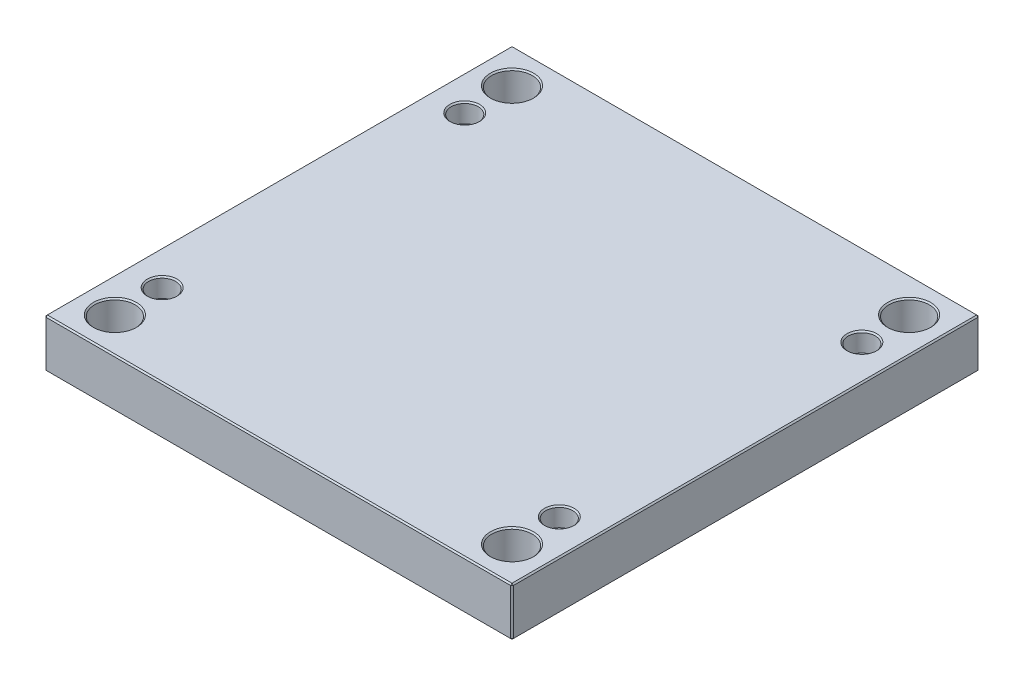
ISO-10303-21;
HEADER;
FILE_DESCRIPTION(('STEP AP214'),'2;1');
FILE_NAME('part.step','',(''),(''),'','','');
FILE_SCHEMA(('AUTOMOTIVE_DESIGN { 1 0 10303 214 1 1 1 1 }'));
ENDSEC;
DATA;
#1=APPLICATION_CONTEXT('core data for automotive mechanical design processes');
#2=APPLICATION_PROTOCOL_DEFINITION('international standard','automotive_design',2000,#1);
#3=PRODUCT_CONTEXT('',#1,'mechanical');
#4=PRODUCT('Part','Part','',(#3));
#5=PRODUCT_RELATED_PRODUCT_CATEGORY('part','',(#4));
#6=PRODUCT_DEFINITION_FORMATION('','',#4);
#7=PRODUCT_DEFINITION_CONTEXT('part definition',#1,'design');
#8=PRODUCT_DEFINITION('design','',#6,#7);
#9=PRODUCT_DEFINITION_SHAPE('','',#8);
#10=(LENGTH_UNIT() NAMED_UNIT(*) SI_UNIT(.MILLI.,.METRE.));
#11=(NAMED_UNIT(*) PLANE_ANGLE_UNIT() SI_UNIT($,.RADIAN.));
#12=(NAMED_UNIT(*) SI_UNIT($,.STERADIAN.) SOLID_ANGLE_UNIT());
#13=UNCERTAINTY_MEASURE_WITH_UNIT(LENGTH_MEASURE(1.E-05),#10,'distance_accuracy_value','');
#14=(GEOMETRIC_REPRESENTATION_CONTEXT(3) GLOBAL_UNCERTAINTY_ASSIGNED_CONTEXT((#13)) GLOBAL_UNIT_ASSIGNED_CONTEXT((#10,
#11,#12)) REPRESENTATION_CONTEXT('',''));
#15=CARTESIAN_POINT('',(0.,0.,0.));
#16=DIRECTION('',(0.,0.,1.));
#17=DIRECTION('',(1.,0.,0.));
#18=AXIS2_PLACEMENT_3D('',#15,#16,#17);
#19=CARTESIAN_POINT('',(-173.,36.,173.));
#20=DIRECTION('',(1.,0.,0.));
#21=DIRECTION('',(0.,0.,-1.));
#22=AXIS2_PLACEMENT_3D('',#19,#20,#21);
#23=PLANE('',#22);
#24=DIRECTION('',(0.,-1.,0.));
#25=VECTOR('',#24,1.);
#26=CARTESIAN_POINT('',(-173.,36.,-172.));
#27=LINE('',#26,#25);
#28=CARTESIAN_POINT('',(-173.,35.,-172.));
#29=VERTEX_POINT('',#28);
#30=CARTESIAN_POINT('',(-173.,1.,-172.));
#31=VERTEX_POINT('',#30);
#32=EDGE_CURVE('E115',#29,#31,#27,.T.);
#33=ORIENTED_EDGE('',*,*,#32,.T.);
#34=DIRECTION('',(0.,0.,1.));
#35=VECTOR('',#34,1.);
#36=CARTESIAN_POINT('',(-173.,1.,173.));
#37=LINE('',#36,#35);
#38=CARTESIAN_POINT('',(-173.,1.,172.));
#39=VERTEX_POINT('',#38);
#40=EDGE_CURVE('E111',#31,#39,#37,.T.);
#41=ORIENTED_EDGE('',*,*,#40,.T.);
#42=DIRECTION('',(0.,1.,0.));
#43=VECTOR('',#42,1.);
#44=CARTESIAN_POINT('',(-173.,36.,172.));
#45=LINE('',#44,#43);
#46=CARTESIAN_POINT('',(-173.,35.,172.));
#47=VERTEX_POINT('',#46);
#48=EDGE_CURVE('E104',#39,#47,#45,.T.);
#49=ORIENTED_EDGE('',*,*,#48,.T.);
#50=DIRECTION('',(0.,0.,-1.));
#51=VECTOR('',#50,1.);
#52=CARTESIAN_POINT('',(-173.,35.,-173.));
#53=LINE('',#52,#51);
#54=EDGE_CURVE('E108',#47,#29,#53,.T.);
#55=ORIENTED_EDGE('',*,*,#54,.T.);
#56=EDGE_LOOP('',(#33,#41,#49,#55));
#57=FACE_BOUND('',#56,.T.);
#58=ADVANCED_FACE('F16',(#57),#23,.F.);
#59=CARTESIAN_POINT('',(173.,36.,173.));
#60=DIRECTION('',(0.,0.,-1.));
#61=DIRECTION('',(-1.,0.,0.));
#62=AXIS2_PLACEMENT_3D('',#59,#60,#61);
#63=PLANE('',#62);
#64=DIRECTION('',(-1.,0.,0.));
#65=VECTOR('',#64,1.);
#66=CARTESIAN_POINT('',(-173.,35.,173.));
#67=LINE('',#66,#65);
#68=CARTESIAN_POINT('',(172.,35.,173.));
#69=VERTEX_POINT('',#68);
#70=CARTESIAN_POINT('',(-172.,35.,173.));
#71=VERTEX_POINT('',#70);
#72=EDGE_CURVE('E170',#69,#71,#67,.T.);
#73=ORIENTED_EDGE('',*,*,#72,.T.);
#74=DIRECTION('',(0.,-1.,0.));
#75=VECTOR('',#74,1.);
#76=CARTESIAN_POINT('',(-172.,36.,173.));
#77=LINE('',#76,#75);
#78=CARTESIAN_POINT('',(-172.,1.,173.));
#79=VERTEX_POINT('',#78);
#80=EDGE_CURVE('E123',#71,#79,#77,.T.);
#81=ORIENTED_EDGE('',*,*,#80,.T.);
#82=DIRECTION('',(1.,0.,0.));
#83=VECTOR('',#82,1.);
#84=CARTESIAN_POINT('',(173.,1.,173.));
#85=LINE('',#84,#83);
#86=CARTESIAN_POINT('',(172.,1.,173.));
#87=VERTEX_POINT('',#86);
#88=EDGE_CURVE('E174',#79,#87,#85,.T.);
#89=ORIENTED_EDGE('',*,*,#88,.T.);
#90=DIRECTION('',(0.,1.,0.));
#91=VECTOR('',#90,1.);
#92=CARTESIAN_POINT('',(172.,36.,173.));
#93=LINE('',#92,#91);
#94=EDGE_CURVE('E172',#87,#69,#93,.T.);
#95=ORIENTED_EDGE('',*,*,#94,.T.);
#96=EDGE_LOOP('',(#73,#81,#89,#95));
#97=FACE_BOUND('',#96,.T.);
#98=ADVANCED_FACE('F413',(#97),#63,.F.);
#99=CARTESIAN_POINT('',(173.,36.,173.));
#100=DIRECTION('',(-1.,0.,0.));
#101=DIRECTION('',(0.,0.,1.));
#102=AXIS2_PLACEMENT_3D('',#99,#100,#101);
#103=PLANE('',#102);
#104=DIRECTION('',(0.,0.,-1.));
#105=VECTOR('',#104,1.);
#106=CARTESIAN_POINT('',(173.,1.,173.));
#107=LINE('',#106,#105);
#108=CARTESIAN_POINT('',(173.,1.,172.));
#109=VERTEX_POINT('',#108);
#110=CARTESIAN_POINT('',(173.,1.,-172.));
#111=VERTEX_POINT('',#110);
#112=EDGE_CURVE('E165',#109,#111,#107,.T.);
#113=ORIENTED_EDGE('',*,*,#112,.T.);
#114=DIRECTION('',(0.,1.,0.));
#115=VECTOR('',#114,1.);
#116=CARTESIAN_POINT('',(173.,36.,-172.));
#117=LINE('',#116,#115);
#118=CARTESIAN_POINT('',(173.,35.,-172.));
#119=VERTEX_POINT('',#118);
#120=EDGE_CURVE('E167',#111,#119,#117,.T.);
#121=ORIENTED_EDGE('',*,*,#120,.T.);
#122=DIRECTION('',(0.,0.,1.));
#123=VECTOR('',#122,1.);
#124=CARTESIAN_POINT('',(173.,35.,173.));
#125=LINE('',#124,#123);
#126=CARTESIAN_POINT('',(173.,35.,172.));
#127=VERTEX_POINT('',#126);
#128=EDGE_CURVE('E161',#119,#127,#125,.T.);
#129=ORIENTED_EDGE('',*,*,#128,.T.);
#130=DIRECTION('',(0.,-1.,0.));
#131=VECTOR('',#130,1.);
#132=CARTESIAN_POINT('',(173.,36.,172.));
#133=LINE('',#132,#131);
#134=EDGE_CURVE('E163',#127,#109,#133,.T.);
#135=ORIENTED_EDGE('',*,*,#134,.T.);
#136=EDGE_LOOP('',(#113,#121,#129,#135));
#137=FACE_BOUND('',#136,.T.);
#138=ADVANCED_FACE('F406',(#137),#103,.F.);
#139=CARTESIAN_POINT('',(173.,36.,-173.));
#140=DIRECTION('',(0.,0.,1.));
#141=DIRECTION('',(1.,0.,0.));
#142=AXIS2_PLACEMENT_3D('',#139,#140,#141);
#143=PLANE('',#142);
#144=DIRECTION('',(0.,-1.,0.));
#145=VECTOR('',#144,1.);
#146=CARTESIAN_POINT('',(172.,36.,-173.));
#147=LINE('',#146,#145);
#148=CARTESIAN_POINT('',(172.,35.,-173.));
#149=VERTEX_POINT('',#148);
#150=CARTESIAN_POINT('',(172.,1.,-173.));
#151=VERTEX_POINT('',#150);
#152=EDGE_CURVE('E154',#149,#151,#147,.T.);
#153=ORIENTED_EDGE('',*,*,#152,.T.);
#154=DIRECTION('',(-1.,0.,0.));
#155=VECTOR('',#154,1.);
#156=CARTESIAN_POINT('',(173.,1.,-173.));
#157=LINE('',#156,#155);
#158=CARTESIAN_POINT('',(-172.,1.,-173.));
#159=VERTEX_POINT('',#158);
#160=EDGE_CURVE('E159',#151,#159,#157,.T.);
#161=ORIENTED_EDGE('',*,*,#160,.T.);
#162=DIRECTION('',(0.,1.,0.));
#163=VECTOR('',#162,1.);
#164=CARTESIAN_POINT('',(-172.,36.,-173.));
#165=LINE('',#164,#163);
#166=CARTESIAN_POINT('',(-172.,35.,-173.));
#167=VERTEX_POINT('',#166);
#168=EDGE_CURVE('E156',#159,#167,#165,.T.);
#169=ORIENTED_EDGE('',*,*,#168,.T.);
#170=DIRECTION('',(1.,0.,0.));
#171=VECTOR('',#170,1.);
#172=CARTESIAN_POINT('',(173.,35.,-173.));
#173=LINE('',#172,#171);
#174=EDGE_CURVE('E152',#167,#149,#173,.T.);
#175=ORIENTED_EDGE('',*,*,#174,.T.);
#176=EDGE_LOOP('',(#153,#161,#169,#175));
#177=FACE_BOUND('',#176,.T.);
#178=ADVANCED_FACE('F431',(#177),#143,.F.);
#179=CARTESIAN_POINT('',(0.,36.,0.));
#180=DIRECTION('',(0.,1.,0.));
#181=DIRECTION('',(0.,0.,1.));
#182=AXIS2_PLACEMENT_3D('',#179,#180,#181);
#183=PLANE('',#182);
#184=CARTESIAN_POINT('',(-147.,36.,147.));
#185=DIRECTION('',(0.,1.,0.));
#186=DIRECTION('',(0.,0.,1.));
#187=AXIS2_PLACEMENT_3D('',#184,#185,#186);
#188=CIRCLE('',#187,16.);
#189=CARTESIAN_POINT('',(-147.,36.,163.));
#190=VERTEX_POINT('',#189);
#191=EDGE_CURVE('E317',#190,#190,#188,.F.);
#192=ORIENTED_EDGE('',*,*,#191,.T.);
#193=EDGE_LOOP('',(#192));
#194=FACE_BOUND('',#193,.T.);
#195=CARTESIAN_POINT('',(147.,36.,147.));
#196=DIRECTION('',(0.,1.,0.));
#197=DIRECTION('',(0.,0.,1.));
#198=AXIS2_PLACEMENT_3D('',#195,#196,#197);
#199=CIRCLE('',#198,16.);
#200=CARTESIAN_POINT('',(147.,36.,163.));
#201=VERTEX_POINT('',#200);
#202=EDGE_CURVE('E314',#201,#201,#199,.F.);
#203=ORIENTED_EDGE('',*,*,#202,.T.);
#204=EDGE_LOOP('',(#203));
#205=FACE_BOUND('',#204,.T.);
#206=CARTESIAN_POINT('',(147.,36.,-147.));
#207=DIRECTION('',(0.,1.,0.));
#208=DIRECTION('',(0.,0.,1.));
#209=AXIS2_PLACEMENT_3D('',#206,#207,#208);
#210=CIRCLE('',#209,16.);
#211=CARTESIAN_POINT('',(147.,36.,-131.));
#212=VERTEX_POINT('',#211);
#213=EDGE_CURVE('E311',#212,#212,#210,.F.);
#214=ORIENTED_EDGE('',*,*,#213,.T.);
#215=EDGE_LOOP('',(#214));
#216=FACE_BOUND('',#215,.T.);
#217=CARTESIAN_POINT('',(-147.,36.,-147.));
#218=DIRECTION('',(0.,1.,0.));
#219=DIRECTION('',(0.,0.,1.));
#220=AXIS2_PLACEMENT_3D('',#217,#218,#219);
#221=CIRCLE('',#220,16.);
#222=CARTESIAN_POINT('',(-147.,36.,-131.));
#223=VERTEX_POINT('',#222);
#224=EDGE_CURVE('E308',#223,#223,#221,.F.);
#225=ORIENTED_EDGE('',*,*,#224,.T.);
#226=EDGE_LOOP('',(#225));
#227=FACE_BOUND('',#226,.T.);
#228=CARTESIAN_POINT('',(-147.,36.,112.));
#229=DIRECTION('',(0.,1.,0.));
#230=DIRECTION('',(0.,0.,1.));
#231=AXIS2_PLACEMENT_3D('',#228,#229,#230);
#232=CIRCLE('',#231,11.);
#233=CARTESIAN_POINT('',(-147.,36.,123.));
#234=VERTEX_POINT('',#233);
#235=EDGE_CURVE('E290',#234,#234,#232,.F.);
#236=ORIENTED_EDGE('',*,*,#235,.T.);
#237=EDGE_LOOP('',(#236));
#238=FACE_BOUND('',#237,.T.);
#239=CARTESIAN_POINT('',(147.,36.,112.));
#240=DIRECTION('',(0.,1.,0.));
#241=DIRECTION('',(0.,0.,1.));
#242=AXIS2_PLACEMENT_3D('',#239,#240,#241);
#243=CIRCLE('',#242,11.);
#244=CARTESIAN_POINT('',(147.,36.,123.));
#245=VERTEX_POINT('',#244);
#246=EDGE_CURVE('E287',#245,#245,#243,.F.);
#247=ORIENTED_EDGE('',*,*,#246,.T.);
#248=EDGE_LOOP('',(#247));
#249=FACE_BOUND('',#248,.T.);
#250=CARTESIAN_POINT('',(147.,36.,-112.));
#251=DIRECTION('',(0.,1.,0.));
#252=DIRECTION('',(0.,0.,1.));
#253=AXIS2_PLACEMENT_3D('',#250,#251,#252);
#254=CIRCLE('',#253,11.);
#255=CARTESIAN_POINT('',(147.,36.,-101.));
#256=VERTEX_POINT('',#255);
#257=EDGE_CURVE('E284',#256,#256,#254,.F.);
#258=ORIENTED_EDGE('',*,*,#257,.T.);
#259=EDGE_LOOP('',(#258));
#260=FACE_BOUND('',#259,.T.);
#261=CARTESIAN_POINT('',(-147.,36.,-112.));
#262=DIRECTION('',(0.,1.,0.));
#263=DIRECTION('',(0.,0.,1.));
#264=AXIS2_PLACEMENT_3D('',#261,#262,#263);
#265=CIRCLE('',#264,11.);
#266=CARTESIAN_POINT('',(-147.,36.,-101.));
#267=VERTEX_POINT('',#266);
#268=EDGE_CURVE('E281',#267,#267,#265,.F.);
#269=ORIENTED_EDGE('',*,*,#268,.T.);
#270=EDGE_LOOP('',(#269));
#271=FACE_BOUND('',#270,.T.);
#272=DIRECTION('',(0.,0.,-1.));
#273=VECTOR('',#272,1.);
#274=CARTESIAN_POINT('',(172.,36.,-173.));
#275=LINE('',#274,#273);
#276=CARTESIAN_POINT('',(172.,36.,172.));
#277=VERTEX_POINT('',#276);
#278=CARTESIAN_POINT('',(172.,36.,-172.));
#279=VERTEX_POINT('',#278);
#280=EDGE_CURVE('E31',#277,#279,#275,.T.);
#281=ORIENTED_EDGE('',*,*,#280,.T.);
#282=DIRECTION('',(-1.,0.,0.));
#283=VECTOR('',#282,1.);
#284=CARTESIAN_POINT('',(-173.,36.,-172.));
#285=LINE('',#284,#283);
#286=CARTESIAN_POINT('',(-172.,36.,-172.));
#287=VERTEX_POINT('',#286);
#288=EDGE_CURVE('E190',#279,#287,#285,.T.);
#289=ORIENTED_EDGE('',*,*,#288,.T.);
#290=DIRECTION('',(0.,0.,1.));
#291=VECTOR('',#290,1.);
#292=CARTESIAN_POINT('',(-172.,36.,173.));
#293=LINE('',#292,#291);
#294=CARTESIAN_POINT('',(-172.,36.,172.));
#295=VERTEX_POINT('',#294);
#296=EDGE_CURVE('E186',#287,#295,#293,.T.);
#297=ORIENTED_EDGE('',*,*,#296,.T.);
#298=DIRECTION('',(1.,0.,0.));
#299=VECTOR('',#298,1.);
#300=CARTESIAN_POINT('',(173.,36.,172.));
#301=LINE('',#300,#299);
#302=EDGE_CURVE('E36',#295,#277,#301,.T.);
#303=ORIENTED_EDGE('',*,*,#302,.T.);
#304=EDGE_LOOP('',(#281,#289,#297,#303));
#305=FACE_BOUND('',#304,.T.);
#306=ADVANCED_FACE('F357',(#194,#205,#216,#227,#238,#249,#260,#271,#305),#183,.T.);
#307=CARTESIAN_POINT('',(0.,0.,0.));
#308=DIRECTION('',(0.,1.,0.));
#309=DIRECTION('',(0.,0.,1.));
#310=AXIS2_PLACEMENT_3D('',#307,#308,#309);
#311=PLANE('',#310);
#312=CARTESIAN_POINT('',(-147.,0.,147.));
#313=DIRECTION('',(0.,1.,0.));
#314=DIRECTION('',(0.,0.,1.));
#315=AXIS2_PLACEMENT_3D('',#312,#313,#314);
#316=CIRCLE('',#315,16.);
#317=CARTESIAN_POINT('',(-147.,0.,163.));
#318=VERTEX_POINT('',#317);
#319=EDGE_CURVE('E329',#318,#318,#316,.T.);
#320=ORIENTED_EDGE('',*,*,#319,.T.);
#321=EDGE_LOOP('',(#320));
#322=FACE_BOUND('',#321,.T.);
#323=CARTESIAN_POINT('',(147.,0.,147.));
#324=DIRECTION('',(0.,1.,0.));
#325=DIRECTION('',(0.,0.,1.));
#326=AXIS2_PLACEMENT_3D('',#323,#324,#325);
#327=CIRCLE('',#326,16.);
#328=CARTESIAN_POINT('',(147.,0.,163.));
#329=VERTEX_POINT('',#328);
#330=EDGE_CURVE('E326',#329,#329,#327,.T.);
#331=ORIENTED_EDGE('',*,*,#330,.T.);
#332=EDGE_LOOP('',(#331));
#333=FACE_BOUND('',#332,.T.);
#334=CARTESIAN_POINT('',(147.,0.,-147.));
#335=DIRECTION('',(0.,1.,0.));
#336=DIRECTION('',(0.,0.,1.));
#337=AXIS2_PLACEMENT_3D('',#334,#335,#336);
#338=CIRCLE('',#337,16.);
#339=CARTESIAN_POINT('',(147.,0.,-131.));
#340=VERTEX_POINT('',#339);
#341=EDGE_CURVE('E323',#340,#340,#338,.T.);
#342=ORIENTED_EDGE('',*,*,#341,.T.);
#343=EDGE_LOOP('',(#342));
#344=FACE_BOUND('',#343,.T.);
#345=CARTESIAN_POINT('',(-147.,0.,-147.));
#346=DIRECTION('',(0.,1.,0.));
#347=DIRECTION('',(0.,0.,1.));
#348=AXIS2_PLACEMENT_3D('',#345,#346,#347);
#349=CIRCLE('',#348,16.);
#350=CARTESIAN_POINT('',(-147.,0.,-131.));
#351=VERTEX_POINT('',#350);
#352=EDGE_CURVE('E320',#351,#351,#349,.T.);
#353=ORIENTED_EDGE('',*,*,#352,.T.);
#354=EDGE_LOOP('',(#353));
#355=FACE_BOUND('',#354,.T.);
#356=CARTESIAN_POINT('',(147.,0.,-112.));
#357=DIRECTION('',(0.,1.,0.));
#358=DIRECTION('',(0.,0.,1.));
#359=AXIS2_PLACEMENT_3D('',#356,#357,#358);
#360=CIRCLE('',#359,8.);
#361=CARTESIAN_POINT('',(147.,0.,-104.));
#362=VERTEX_POINT('',#361);
#363=EDGE_CURVE('E263',#362,#362,#360,.T.);
#364=ORIENTED_EDGE('',*,*,#363,.T.);
#365=EDGE_LOOP('',(#364));
#366=FACE_BOUND('',#365,.T.);
#367=CARTESIAN_POINT('',(147.,0.,112.));
#368=DIRECTION('',(0.,1.,0.));
#369=DIRECTION('',(0.,0.,1.));
#370=AXIS2_PLACEMENT_3D('',#367,#368,#369);
#371=CIRCLE('',#370,8.);
#372=CARTESIAN_POINT('',(147.,0.,120.));
#373=VERTEX_POINT('',#372);
#374=EDGE_CURVE('E260',#373,#373,#371,.T.);
#375=ORIENTED_EDGE('',*,*,#374,.T.);
#376=EDGE_LOOP('',(#375));
#377=FACE_BOUND('',#376,.T.);
#378=CARTESIAN_POINT('',(-147.,0.,112.));
#379=DIRECTION('',(0.,1.,0.));
#380=DIRECTION('',(0.,0.,1.));
#381=AXIS2_PLACEMENT_3D('',#378,#379,#380);
#382=CIRCLE('',#381,8.);
#383=CARTESIAN_POINT('',(-147.,0.,120.));
#384=VERTEX_POINT('',#383);
#385=EDGE_CURVE('E257',#384,#384,#382,.T.);
#386=ORIENTED_EDGE('',*,*,#385,.T.);
#387=EDGE_LOOP('',(#386));
#388=FACE_BOUND('',#387,.T.);
#389=CARTESIAN_POINT('',(-147.,0.,-112.));
#390=DIRECTION('',(0.,1.,0.));
#391=DIRECTION('',(0.,0.,1.));
#392=AXIS2_PLACEMENT_3D('',#389,#390,#391);
#393=CIRCLE('',#392,8.);
#394=CARTESIAN_POINT('',(-147.,0.,-104.));
#395=VERTEX_POINT('',#394);
#396=EDGE_CURVE('E192',#395,#395,#393,.T.);
#397=ORIENTED_EDGE('',*,*,#396,.T.);
#398=EDGE_LOOP('',(#397));
#399=FACE_BOUND('',#398,.T.);
#400=DIRECTION('',(0.,0.,1.));
#401=VECTOR('',#400,1.);
#402=CARTESIAN_POINT('',(172.,0.,0.));
#403=LINE('',#402,#401);
#404=CARTESIAN_POINT('',(172.,0.,-172.));
#405=VERTEX_POINT('',#404);
#406=CARTESIAN_POINT('',(172.,0.,172.));
#407=VERTEX_POINT('',#406);
#408=EDGE_CURVE('E177',#405,#407,#403,.T.);
#409=ORIENTED_EDGE('',*,*,#408,.T.);
#410=DIRECTION('',(-1.,0.,0.));
#411=VECTOR('',#410,1.);
#412=CARTESIAN_POINT('',(0.,0.,172.));
#413=LINE('',#412,#411);
#414=CARTESIAN_POINT('',(-172.,0.,172.));
#415=VERTEX_POINT('',#414);
#416=EDGE_CURVE('E183',#407,#415,#413,.T.);
#417=ORIENTED_EDGE('',*,*,#416,.T.);
#418=DIRECTION('',(0.,0.,-1.));
#419=VECTOR('',#418,1.);
#420=CARTESIAN_POINT('',(-172.,0.,0.));
#421=LINE('',#420,#419);
#422=CARTESIAN_POINT('',(-172.,0.,-172.));
#423=VERTEX_POINT('',#422);
#424=EDGE_CURVE('E181',#415,#423,#421,.T.);
#425=ORIENTED_EDGE('',*,*,#424,.T.);
#426=DIRECTION('',(1.,0.,0.));
#427=VECTOR('',#426,1.);
#428=CARTESIAN_POINT('',(0.,0.,-172.));
#429=LINE('',#428,#427);
#430=EDGE_CURVE('E179',#423,#405,#429,.T.);
#431=ORIENTED_EDGE('',*,*,#430,.T.);
#432=EDGE_LOOP('',(#409,#417,#425,#431));
#433=FACE_BOUND('',#432,.T.);
#434=ADVANCED_FACE('F353',(#322,#333,#344,#355,#366,#377,#388,#399,#433),#311,.F.);
#435=CARTESIAN_POINT('',(173.,36.,172.));
#436=DIRECTION('',(-0.707106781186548,0.,-0.707106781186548));
#437=DIRECTION('',(0.,-1.,0.));
#438=AXIS2_PLACEMENT_3D('',#435,#436,#437);
#439=PLANE('',#438);
#440=DIRECTION('',(-0.707106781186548,0.,0.707106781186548));
#441=VECTOR('',#440,1.);
#442=CARTESIAN_POINT('',(172.,35.,173.));
#443=LINE('',#442,#441);
#444=EDGE_CURVE('E141',#69,#127,#443,.F.);
#445=ORIENTED_EDGE('',*,*,#444,.F.);
#446=ORIENTED_EDGE('',*,*,#94,.F.);
#447=DIRECTION('',(0.707106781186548,0.,-0.707106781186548));
#448=VECTOR('',#447,1.);
#449=CARTESIAN_POINT('',(172.,1.,173.));
#450=LINE('',#449,#448);
#451=EDGE_CURVE('E144',#109,#87,#450,.F.);
#452=ORIENTED_EDGE('',*,*,#451,.F.);
#453=ORIENTED_EDGE('',*,*,#134,.F.);
#454=EDGE_LOOP('',(#445,#446,#452,#453));
#455=FACE_BOUND('',#454,.T.);
#456=ADVANCED_FACE('F356',(#455),#439,.F.);
#457=CARTESIAN_POINT('',(172.,35.,173.));
#458=DIRECTION('',(0.577350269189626,0.577350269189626,0.577350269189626));
#459=DIRECTION('',(0.707106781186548,0.,-0.707106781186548));
#460=AXIS2_PLACEMENT_3D('',#457,#458,#459);
#461=PLANE('',#460);
#462=DIRECTION('',(0.,-0.707106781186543,0.707106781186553));
#463=VECTOR('',#462,1.);
#464=CARTESIAN_POINT('',(172.,35.,173.));
#465=LINE('',#464,#463);
#466=EDGE_CURVE('E235',#69,#277,#465,.F.);
#467=ORIENTED_EDGE('',*,*,#466,.F.);
#468=ORIENTED_EDGE('',*,*,#444,.T.);
#469=DIRECTION('',(-0.707106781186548,0.707106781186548,0.));
#470=VECTOR('',#469,1.);
#471=CARTESIAN_POINT('',(172.5,35.5,172.));
#472=LINE('',#471,#470);
#473=EDGE_CURVE('E237',#277,#127,#472,.F.);
#474=ORIENTED_EDGE('',*,*,#473,.F.);
#475=EDGE_LOOP('',(#467,#468,#474));
#476=FACE_BOUND('',#475,.T.);
#477=ADVANCED_FACE('F419',(#476),#461,.T.);
#478=CARTESIAN_POINT('',(172.,1.,173.));
#479=DIRECTION('',(0.57735026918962,-0.577350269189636,0.57735026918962));
#480=DIRECTION('',(0.,-0.707106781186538,-0.707106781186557));
#481=AXIS2_PLACEMENT_3D('',#478,#479,#480);
#482=PLANE('',#481);
#483=DIRECTION('',(-0.707106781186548,-0.707106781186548,0.));
#484=VECTOR('',#483,1.);
#485=CARTESIAN_POINT('',(172.5,0.500000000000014,172.));
#486=LINE('',#485,#484);
#487=EDGE_CURVE('E229',#109,#407,#486,.T.);
#488=ORIENTED_EDGE('',*,*,#487,.F.);
#489=ORIENTED_EDGE('',*,*,#451,.T.);
#490=DIRECTION('',(0.,0.707106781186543,0.707106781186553));
#491=VECTOR('',#490,1.);
#492=CARTESIAN_POINT('',(172.,1.,173.));
#493=LINE('',#492,#491);
#494=EDGE_CURVE('E232',#407,#87,#493,.T.);
#495=ORIENTED_EDGE('',*,*,#494,.F.);
#496=EDGE_LOOP('',(#488,#489,#495));
#497=FACE_BOUND('',#496,.T.);
#498=ADVANCED_FACE('F378',(#497),#482,.T.);
#499=CARTESIAN_POINT('',(172.,36.,0.));
#500=DIRECTION('',(0.707106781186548,0.707106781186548,0.));
#501=DIRECTION('',(0.,0.,1.));
#502=AXIS2_PLACEMENT_3D('',#499,#500,#501);
#503=PLANE('',#502);
#504=ORIENTED_EDGE('',*,*,#473,.T.);
#505=ORIENTED_EDGE('',*,*,#128,.F.);
#506=DIRECTION('',(0.707106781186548,-0.707106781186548,0.));
#507=VECTOR('',#506,1.);
#508=CARTESIAN_POINT('',(173.,35.,-172.));
#509=LINE('',#508,#507);
#510=EDGE_CURVE('E224',#279,#119,#509,.T.);
#511=ORIENTED_EDGE('',*,*,#510,.F.);
#512=ORIENTED_EDGE('',*,*,#280,.F.);
#513=EDGE_LOOP('',(#504,#505,#511,#512));
#514=FACE_BOUND('',#513,.T.);
#515=ADVANCED_FACE('F421',(#514),#503,.T.);
#516=CARTESIAN_POINT('',(0.,36.,172.));
#517=DIRECTION('',(0.,0.707106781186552,0.707106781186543));
#518=DIRECTION('',(-1.,0.,0.));
#519=AXIS2_PLACEMENT_3D('',#516,#517,#518);
#520=PLANE('',#519);
#521=ORIENTED_EDGE('',*,*,#466,.T.);
#522=ORIENTED_EDGE('',*,*,#302,.F.);
#523=DIRECTION('',(0.,0.707106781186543,-0.707106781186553));
#524=VECTOR('',#523,1.);
#525=CARTESIAN_POINT('',(-172.,35.5,172.5));
#526=LINE('',#525,#524);
#527=EDGE_CURVE('E127',#71,#295,#526,.T.);
#528=ORIENTED_EDGE('',*,*,#527,.F.);
#529=ORIENTED_EDGE('',*,*,#72,.F.);
#530=EDGE_LOOP('',(#521,#522,#528,#529));
#531=FACE_BOUND('',#530,.T.);
#532=ADVANCED_FACE('F416',(#531),#520,.T.);
#533=CARTESIAN_POINT('',(-172.,36.,173.));
#534=DIRECTION('',(0.707106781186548,0.,-0.707106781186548));
#535=DIRECTION('',(0.,-1.,0.));
#536=AXIS2_PLACEMENT_3D('',#533,#534,#535);
#537=PLANE('',#536);
#538=DIRECTION('',(0.707106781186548,0.,0.707106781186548));
#539=VECTOR('',#538,1.);
#540=CARTESIAN_POINT('',(-172.,1.,173.));
#541=LINE('',#540,#539);
#542=EDGE_CURVE('E128',#79,#39,#541,.F.);
#543=ORIENTED_EDGE('',*,*,#542,.F.);
#544=ORIENTED_EDGE('',*,*,#80,.F.);
#545=DIRECTION('',(-0.707106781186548,0.,-0.707106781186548));
#546=VECTOR('',#545,1.);
#547=CARTESIAN_POINT('',(-173.,35.,172.));
#548=LINE('',#547,#546);
#549=EDGE_CURVE('E119',#47,#71,#548,.F.);
#550=ORIENTED_EDGE('',*,*,#549,.F.);
#551=ORIENTED_EDGE('',*,*,#48,.F.);
#552=EDGE_LOOP('',(#543,#544,#550,#551));
#553=FACE_BOUND('',#552,.T.);
#554=ADVANCED_FACE('F121',(#553),#537,.F.);
#555=CARTESIAN_POINT('',(173.,1.,173.));
#556=DIRECTION('',(0.,0.707106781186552,-0.707106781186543));
#557=DIRECTION('',(1.,0.,0.));
#558=AXIS2_PLACEMENT_3D('',#555,#556,#557);
#559=PLANE('',#558);
#560=ORIENTED_EDGE('',*,*,#494,.T.);
#561=ORIENTED_EDGE('',*,*,#88,.F.);
#562=DIRECTION('',(0.,-0.707106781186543,-0.707106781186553));
#563=VECTOR('',#562,1.);
#564=CARTESIAN_POINT('',(-172.,1.,173.));
#565=LINE('',#564,#563);
#566=EDGE_CURVE('E220',#415,#79,#565,.F.);
#567=ORIENTED_EDGE('',*,*,#566,.F.);
#568=ORIENTED_EDGE('',*,*,#416,.F.);
#569=EDGE_LOOP('',(#560,#561,#567,#568));
#570=FACE_BOUND('',#569,.T.);
#571=ADVANCED_FACE('F383',(#570),#559,.F.);
#572=CARTESIAN_POINT('',(173.,1.,173.));
#573=DIRECTION('',(-0.707106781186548,0.707106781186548,0.));
#574=DIRECTION('',(0.,0.,-1.));
#575=AXIS2_PLACEMENT_3D('',#572,#573,#574);
#576=PLANE('',#575);
#577=ORIENTED_EDGE('',*,*,#487,.T.);
#578=ORIENTED_EDGE('',*,*,#408,.F.);
#579=DIRECTION('',(0.707106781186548,0.707106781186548,0.));
#580=VECTOR('',#579,1.);
#581=CARTESIAN_POINT('',(172.5,0.499999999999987,-172.));
#582=LINE('',#581,#580);
#583=EDGE_CURVE('E217',#111,#405,#582,.F.);
#584=ORIENTED_EDGE('',*,*,#583,.F.);
#585=ORIENTED_EDGE('',*,*,#112,.F.);
#586=EDGE_LOOP('',(#577,#578,#584,#585));
#587=FACE_BOUND('',#586,.T.);
#588=ADVANCED_FACE('F376',(#587),#576,.F.);
#589=CARTESIAN_POINT('',(172.,36.,-173.));
#590=DIRECTION('',(-0.707106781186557,0.,0.707106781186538));
#591=DIRECTION('',(0.,-1.,0.));
#592=AXIS2_PLACEMENT_3D('',#589,#590,#591);
#593=PLANE('',#592);
#594=DIRECTION('',(0.707106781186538,0.,0.707106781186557));
#595=VECTOR('',#594,1.);
#596=CARTESIAN_POINT('',(173.,35.,-172.));
#597=LINE('',#596,#595);
#598=EDGE_CURVE('E226',#119,#149,#597,.F.);
#599=ORIENTED_EDGE('',*,*,#598,.F.);
#600=ORIENTED_EDGE('',*,*,#120,.F.);
#601=DIRECTION('',(-0.707106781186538,0.,-0.707106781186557));
#602=VECTOR('',#601,1.);
#603=CARTESIAN_POINT('',(172.,1.,-173.));
#604=LINE('',#603,#602);
#605=EDGE_CURVE('E214',#151,#111,#604,.F.);
#606=ORIENTED_EDGE('',*,*,#605,.F.);
#607=ORIENTED_EDGE('',*,*,#152,.F.);
#608=EDGE_LOOP('',(#599,#600,#606,#607));
#609=FACE_BOUND('',#608,.T.);
#610=ADVANCED_FACE('F403',(#609),#593,.F.);
#611=CARTESIAN_POINT('',(173.,35.,-172.));
#612=DIRECTION('',(0.577350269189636,0.57735026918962,-0.57735026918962));
#613=DIRECTION('',(-0.707106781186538,0.,-0.707106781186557));
#614=AXIS2_PLACEMENT_3D('',#611,#612,#613);
#615=PLANE('',#614);
#616=ORIENTED_EDGE('',*,*,#510,.T.);
#617=ORIENTED_EDGE('',*,*,#598,.T.);
#618=DIRECTION('',(0.,0.707106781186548,0.707106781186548));
#619=VECTOR('',#618,1.);
#620=CARTESIAN_POINT('',(172.,35.5,-172.5));
#621=LINE('',#620,#619);
#622=EDGE_CURVE('E135',#279,#149,#621,.F.);
#623=ORIENTED_EDGE('',*,*,#622,.F.);
#624=EDGE_LOOP('',(#616,#617,#623));
#625=FACE_BOUND('',#624,.T.);
#626=ADVANCED_FACE('F425',(#625),#615,.T.);
#627=CARTESIAN_POINT('',(-173.,35.,172.));
#628=DIRECTION('',(-0.577350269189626,0.577350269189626,0.577350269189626));
#629=DIRECTION('',(0.707106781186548,0.,0.707106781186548));
#630=AXIS2_PLACEMENT_3D('',#627,#628,#629);
#631=PLANE('',#630);
#632=ORIENTED_EDGE('',*,*,#549,.T.);
#633=ORIENTED_EDGE('',*,*,#527,.T.);
#634=DIRECTION('',(-0.707106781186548,-0.707106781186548,0.));
#635=VECTOR('',#634,1.);
#636=CARTESIAN_POINT('',(-173.,35.,172.));
#637=LINE('',#636,#635);
#638=EDGE_CURVE('E131',#47,#295,#637,.F.);
#639=ORIENTED_EDGE('',*,*,#638,.F.);
#640=EDGE_LOOP('',(#632,#633,#639));
#641=FACE_BOUND('',#640,.T.);
#642=ADVANCED_FACE('F132',(#641),#631,.T.);
#643=CARTESIAN_POINT('',(-172.,1.,173.));
#644=DIRECTION('',(-0.57735026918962,-0.577350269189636,0.57735026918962));
#645=DIRECTION('',(0.,-0.707106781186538,-0.707106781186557));
#646=AXIS2_PLACEMENT_3D('',#643,#644,#645);
#647=PLANE('',#646);
#648=ORIENTED_EDGE('',*,*,#566,.T.);
#649=ORIENTED_EDGE('',*,*,#542,.T.);
#650=DIRECTION('',(-0.707106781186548,0.707106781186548,0.));
#651=VECTOR('',#650,1.);
#652=CARTESIAN_POINT('',(-172.5,0.500000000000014,172.));
#653=LINE('',#652,#651);
#654=EDGE_CURVE('E136',#415,#39,#653,.T.);
#655=ORIENTED_EDGE('',*,*,#654,.F.);
#656=EDGE_LOOP('',(#648,#649,#655));
#657=FACE_BOUND('',#656,.T.);
#658=ADVANCED_FACE('F386',(#657),#647,.T.);
#659=CARTESIAN_POINT('',(172.,1.,-173.));
#660=DIRECTION('',(0.577350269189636,-0.57735026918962,-0.57735026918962));
#661=DIRECTION('',(-0.707106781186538,0.,-0.707106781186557));
#662=AXIS2_PLACEMENT_3D('',#659,#660,#661);
#663=PLANE('',#662);
#664=ORIENTED_EDGE('',*,*,#605,.T.);
#665=ORIENTED_EDGE('',*,*,#583,.T.);
#666=DIRECTION('',(0.,-0.707106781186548,0.707106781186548));
#667=VECTOR('',#666,1.);
#668=CARTESIAN_POINT('',(172.,1.,-173.));
#669=LINE('',#668,#667);
#670=EDGE_CURVE('E207',#151,#405,#669,.T.);
#671=ORIENTED_EDGE('',*,*,#670,.F.);
#672=EDGE_LOOP('',(#664,#665,#671));
#673=FACE_BOUND('',#672,.T.);
#674=ADVANCED_FACE('F397',(#673),#663,.T.);
#675=CARTESIAN_POINT('',(0.,36.,-172.));
#676=DIRECTION('',(0.,0.707106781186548,-0.707106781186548));
#677=DIRECTION('',(1.,0.,0.));
#678=AXIS2_PLACEMENT_3D('',#675,#676,#677);
#679=PLANE('',#678);
#680=ORIENTED_EDGE('',*,*,#622,.T.);
#681=ORIENTED_EDGE('',*,*,#174,.F.);
#682=DIRECTION('',(0.,-0.707106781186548,-0.707106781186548));
#683=VECTOR('',#682,1.);
#684=CARTESIAN_POINT('',(-172.,35.,-173.));
#685=LINE('',#684,#683);
#686=EDGE_CURVE('E204',#287,#167,#685,.T.);
#687=ORIENTED_EDGE('',*,*,#686,.F.);
#688=ORIENTED_EDGE('',*,*,#288,.F.);
#689=EDGE_LOOP('',(#680,#681,#687,#688));
#690=FACE_BOUND('',#689,.T.);
#691=ADVANCED_FACE('F429',(#690),#679,.T.);
#692=CARTESIAN_POINT('',(-172.,36.,0.));
#693=DIRECTION('',(-0.707106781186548,0.707106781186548,0.));
#694=DIRECTION('',(0.,0.,-1.));
#695=AXIS2_PLACEMENT_3D('',#692,#693,#694);
#696=PLANE('',#695);
#697=ORIENTED_EDGE('',*,*,#638,.T.);
#698=ORIENTED_EDGE('',*,*,#296,.F.);
#699=DIRECTION('',(0.707106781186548,0.707106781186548,0.));
#700=VECTOR('',#699,1.);
#701=CARTESIAN_POINT('',(-172.5,35.5,-172.));
#702=LINE('',#701,#700);
#703=EDGE_CURVE('E139',#29,#287,#702,.T.);
#704=ORIENTED_EDGE('',*,*,#703,.F.);
#705=ORIENTED_EDGE('',*,*,#54,.F.);
#706=EDGE_LOOP('',(#697,#698,#704,#705));
#707=FACE_BOUND('',#706,.T.);
#708=ADVANCED_FACE('F138',(#707),#696,.T.);
#709=CARTESIAN_POINT('',(-173.,1.,173.));
#710=DIRECTION('',(0.707106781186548,0.707106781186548,0.));
#711=DIRECTION('',(0.,0.,1.));
#712=AXIS2_PLACEMENT_3D('',#709,#710,#711);
#713=PLANE('',#712);
#714=ORIENTED_EDGE('',*,*,#654,.T.);
#715=ORIENTED_EDGE('',*,*,#40,.F.);
#716=DIRECTION('',(0.707106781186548,-0.707106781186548,0.));
#717=VECTOR('',#716,1.);
#718=CARTESIAN_POINT('',(-173.,1.,-172.));
#719=LINE('',#718,#717);
#720=EDGE_CURVE('E200',#423,#31,#719,.F.);
#721=ORIENTED_EDGE('',*,*,#720,.F.);
#722=ORIENTED_EDGE('',*,*,#424,.F.);
#723=EDGE_LOOP('',(#714,#715,#721,#722));
#724=FACE_BOUND('',#723,.T.);
#725=ADVANCED_FACE('F388',(#724),#713,.F.);
#726=CARTESIAN_POINT('',(173.,1.,-173.));
#727=DIRECTION('',(0.,0.707106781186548,0.707106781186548));
#728=DIRECTION('',(-1.,0.,0.));
#729=AXIS2_PLACEMENT_3D('',#726,#727,#728);
#730=PLANE('',#729);
#731=ORIENTED_EDGE('',*,*,#670,.T.);
#732=ORIENTED_EDGE('',*,*,#430,.F.);
#733=DIRECTION('',(0.,0.707106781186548,-0.707106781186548));
#734=VECTOR('',#733,1.);
#735=CARTESIAN_POINT('',(-172.,0.5,-172.5));
#736=LINE('',#735,#734);
#737=EDGE_CURVE('E197',#159,#423,#736,.F.);
#738=ORIENTED_EDGE('',*,*,#737,.F.);
#739=ORIENTED_EDGE('',*,*,#160,.F.);
#740=EDGE_LOOP('',(#731,#732,#738,#739));
#741=FACE_BOUND('',#740,.T.);
#742=ADVANCED_FACE('F392',(#741),#730,.F.);
#743=CARTESIAN_POINT('',(-172.,35.,-173.));
#744=DIRECTION('',(-0.577350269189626,0.577350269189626,-0.577350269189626));
#745=DIRECTION('',(-0.707106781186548,0.,0.707106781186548));
#746=AXIS2_PLACEMENT_3D('',#743,#744,#745);
#747=PLANE('',#746);
#748=ORIENTED_EDGE('',*,*,#703,.T.);
#749=ORIENTED_EDGE('',*,*,#686,.T.);
#750=DIRECTION('',(0.707106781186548,0.,-0.707106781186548));
#751=VECTOR('',#750,1.);
#752=CARTESIAN_POINT('',(-172.,35.,-173.));
#753=LINE('',#752,#751);
#754=EDGE_CURVE('E195',#29,#167,#753,.T.);
#755=ORIENTED_EDGE('',*,*,#754,.F.);
#756=EDGE_LOOP('',(#748,#749,#755));
#757=FACE_BOUND('',#756,.T.);
#758=ADVANCED_FACE('F460',(#757),#747,.T.);
#759=CARTESIAN_POINT('',(-173.,1.,-172.));
#760=DIRECTION('',(-0.577350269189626,-0.577350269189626,-0.577350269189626));
#761=DIRECTION('',(-0.707106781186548,0.,0.707106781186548));
#762=AXIS2_PLACEMENT_3D('',#759,#760,#761);
#763=PLANE('',#762);
#764=ORIENTED_EDGE('',*,*,#737,.T.);
#765=ORIENTED_EDGE('',*,*,#720,.T.);
#766=DIRECTION('',(-0.707106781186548,0.,0.707106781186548));
#767=VECTOR('',#766,1.);
#768=CARTESIAN_POINT('',(-173.,1.,-172.));
#769=LINE('',#768,#767);
#770=EDGE_CURVE('E193',#159,#31,#769,.T.);
#771=ORIENTED_EDGE('',*,*,#770,.F.);
#772=EDGE_LOOP('',(#764,#765,#771));
#773=FACE_BOUND('',#772,.T.);
#774=ADVANCED_FACE('F456',(#773),#763,.T.);
#775=CARTESIAN_POINT('',(-173.,36.,-172.));
#776=DIRECTION('',(0.707106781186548,0.,0.707106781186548));
#777=DIRECTION('',(0.,-1.,0.));
#778=AXIS2_PLACEMENT_3D('',#775,#776,#777);
#779=PLANE('',#778);
#780=ORIENTED_EDGE('',*,*,#754,.T.);
#781=ORIENTED_EDGE('',*,*,#168,.F.);
#782=ORIENTED_EDGE('',*,*,#770,.T.);
#783=ORIENTED_EDGE('',*,*,#32,.F.);
#784=EDGE_LOOP('',(#780,#781,#782,#783));
#785=FACE_BOUND('',#784,.T.);
#786=ADVANCED_FACE('F452',(#785),#779,.F.);
#787=CARTESIAN_POINT('',(-147.,22.,-112.));
#788=DIRECTION('',(0.,1.,0.));
#789=DIRECTION('',(0.,0.,1.));
#790=AXIS2_PLACEMENT_3D('',#787,#788,#789);
#791=CYLINDRICAL_SURFACE('',#790,10.);
#792=CARTESIAN_POINT('',(-147.,35.,-112.));
#793=DIRECTION('',(0.,1.,0.));
#794=DIRECTION('',(0.,0.,1.));
#795=AXIS2_PLACEMENT_3D('',#792,#793,#794);
#796=CIRCLE('',#795,10.);
#797=CARTESIAN_POINT('',(-147.,35.,-102.));
#798=VERTEX_POINT('',#797);
#799=EDGE_CURVE('E299',#798,#798,#796,.T.);
#800=ORIENTED_EDGE('',*,*,#799,.T.);
#801=EDGE_LOOP('',(#800));
#802=FACE_BOUND('',#801,.T.);
#803=CARTESIAN_POINT('',(-147.,22.,-112.));
#804=DIRECTION('',(0.,1.,0.));
#805=DIRECTION('',(0.,0.,1.));
#806=AXIS2_PLACEMENT_3D('',#803,#804,#805);
#807=CIRCLE('',#806,10.);
#808=CARTESIAN_POINT('',(-147.,22.,-102.));
#809=VERTEX_POINT('',#808);
#810=EDGE_CURVE('E147',#809,#809,#807,.T.);
#811=ORIENTED_EDGE('',*,*,#810,.F.);
#812=EDGE_LOOP('',(#811));
#813=FACE_BOUND('',#812,.T.);
#814=ADVANCED_FACE('F455',(#802,#813),#791,.F.);
#815=CARTESIAN_POINT('',(-147.,22.,-112.));
#816=DIRECTION('',(0.,1.,0.));
#817=DIRECTION('',(0.,0.,1.));
#818=AXIS2_PLACEMENT_3D('',#815,#816,#817);
#819=PLANE('',#818);
#820=CARTESIAN_POINT('',(-147.,22.,-112.));
#821=DIRECTION('',(0.,1.,0.));
#822=DIRECTION('',(0.,0.,1.));
#823=AXIS2_PLACEMENT_3D('',#820,#821,#822);
#824=CIRCLE('',#823,7.);
#825=CARTESIAN_POINT('',(-147.,22.,-105.));
#826=VERTEX_POINT('',#825);
#827=EDGE_CURVE('E251',#826,#826,#824,.T.);
#828=ORIENTED_EDGE('',*,*,#827,.F.);
#829=EDGE_LOOP('',(#828));
#830=FACE_BOUND('',#829,.T.);
#831=ORIENTED_EDGE('',*,*,#810,.T.);
#832=EDGE_LOOP('',(#831));
#833=FACE_BOUND('',#832,.T.);
#834=ADVANCED_FACE('F602',(#830,#833),#819,.T.);
#835=CARTESIAN_POINT('',(147.,22.,-112.));
#836=DIRECTION('',(0.,1.,0.));
#837=DIRECTION('',(0.,0.,1.));
#838=AXIS2_PLACEMENT_3D('',#835,#836,#837);
#839=CYLINDRICAL_SURFACE('',#838,10.);
#840=CARTESIAN_POINT('',(147.,35.,-112.));
#841=DIRECTION('',(0.,1.,0.));
#842=DIRECTION('',(0.,0.,1.));
#843=AXIS2_PLACEMENT_3D('',#840,#841,#842);
#844=CIRCLE('',#843,10.);
#845=CARTESIAN_POINT('',(147.,35.,-102.));
#846=VERTEX_POINT('',#845);
#847=EDGE_CURVE('E296',#846,#846,#844,.T.);
#848=ORIENTED_EDGE('',*,*,#847,.T.);
#849=EDGE_LOOP('',(#848));
#850=FACE_BOUND('',#849,.T.);
#851=CARTESIAN_POINT('',(147.,22.,-112.));
#852=DIRECTION('',(0.,1.,0.));
#853=DIRECTION('',(0.,0.,1.));
#854=AXIS2_PLACEMENT_3D('',#851,#852,#853);
#855=CIRCLE('',#854,10.);
#856=CARTESIAN_POINT('',(147.,22.,-102.));
#857=VERTEX_POINT('',#856);
#858=EDGE_CURVE('E630',#857,#857,#855,.T.);
#859=ORIENTED_EDGE('',*,*,#858,.F.);
#860=EDGE_LOOP('',(#859));
#861=FACE_BOUND('',#860,.T.);
#862=ADVANCED_FACE('F598',(#850,#861),#839,.F.);
#863=CARTESIAN_POINT('',(147.,22.,-112.));
#864=DIRECTION('',(0.,1.,0.));
#865=DIRECTION('',(0.,0.,1.));
#866=AXIS2_PLACEMENT_3D('',#863,#864,#865);
#867=PLANE('',#866);
#868=CARTESIAN_POINT('',(147.,22.,-112.));
#869=DIRECTION('',(0.,1.,0.));
#870=DIRECTION('',(0.,0.,1.));
#871=AXIS2_PLACEMENT_3D('',#868,#869,#870);
#872=CIRCLE('',#871,7.);
#873=CARTESIAN_POINT('',(147.,22.,-105.));
#874=VERTEX_POINT('',#873);
#875=EDGE_CURVE('E248',#874,#874,#872,.T.);
#876=ORIENTED_EDGE('',*,*,#875,.F.);
#877=EDGE_LOOP('',(#876));
#878=FACE_BOUND('',#877,.T.);
#879=ORIENTED_EDGE('',*,*,#858,.T.);
#880=EDGE_LOOP('',(#879));
#881=FACE_BOUND('',#880,.T.);
#882=ADVANCED_FACE('F594',(#878,#881),#867,.T.);
#883=CARTESIAN_POINT('',(147.,22.,112.));
#884=DIRECTION('',(0.,1.,0.));
#885=DIRECTION('',(0.,0.,1.));
#886=AXIS2_PLACEMENT_3D('',#883,#884,#885);
#887=CYLINDRICAL_SURFACE('',#886,10.);
#888=CARTESIAN_POINT('',(147.,35.,112.));
#889=DIRECTION('',(0.,1.,0.));
#890=DIRECTION('',(0.,0.,1.));
#891=AXIS2_PLACEMENT_3D('',#888,#889,#890);
#892=CIRCLE('',#891,10.);
#893=CARTESIAN_POINT('',(147.,35.,122.));
#894=VERTEX_POINT('',#893);
#895=EDGE_CURVE('E293',#894,#894,#892,.T.);
#896=ORIENTED_EDGE('',*,*,#895,.T.);
#897=EDGE_LOOP('',(#896));
#898=FACE_BOUND('',#897,.T.);
#899=CARTESIAN_POINT('',(147.,22.,112.));
#900=DIRECTION('',(0.,1.,0.));
#901=DIRECTION('',(0.,0.,1.));
#902=AXIS2_PLACEMENT_3D('',#899,#900,#901);
#903=CIRCLE('',#902,10.);
#904=CARTESIAN_POINT('',(147.,22.,122.));
#905=VERTEX_POINT('',#904);
#906=EDGE_CURVE('E632',#905,#905,#903,.T.);
#907=ORIENTED_EDGE('',*,*,#906,.F.);
#908=EDGE_LOOP('',(#907));
#909=FACE_BOUND('',#908,.T.);
#910=ADVANCED_FACE('F597',(#898,#909),#887,.F.);
#911=CARTESIAN_POINT('',(147.,22.,112.));
#912=DIRECTION('',(0.,1.,0.));
#913=DIRECTION('',(0.,0.,1.));
#914=AXIS2_PLACEMENT_3D('',#911,#912,#913);
#915=PLANE('',#914);
#916=CARTESIAN_POINT('',(147.,22.,112.));
#917=DIRECTION('',(0.,1.,0.));
#918=DIRECTION('',(0.,0.,1.));
#919=AXIS2_PLACEMENT_3D('',#916,#917,#918);
#920=CIRCLE('',#919,7.);
#921=CARTESIAN_POINT('',(147.,22.,119.));
#922=VERTEX_POINT('',#921);
#923=EDGE_CURVE('E245',#922,#922,#920,.T.);
#924=ORIENTED_EDGE('',*,*,#923,.F.);
#925=EDGE_LOOP('',(#924));
#926=FACE_BOUND('',#925,.T.);
#927=ORIENTED_EDGE('',*,*,#906,.T.);
#928=EDGE_LOOP('',(#927));
#929=FACE_BOUND('',#928,.T.);
#930=ADVANCED_FACE('F604',(#926,#929),#915,.T.);
#931=CARTESIAN_POINT('',(-147.,22.,112.));
#932=DIRECTION('',(0.,1.,0.));
#933=DIRECTION('',(0.,0.,1.));
#934=AXIS2_PLACEMENT_3D('',#931,#932,#933);
#935=CYLINDRICAL_SURFACE('',#934,10.);
#936=CARTESIAN_POINT('',(-147.,35.,112.));
#937=DIRECTION('',(0.,1.,0.));
#938=DIRECTION('',(0.,0.,1.));
#939=AXIS2_PLACEMENT_3D('',#936,#937,#938);
#940=CIRCLE('',#939,10.);
#941=CARTESIAN_POINT('',(-147.,35.,122.));
#942=VERTEX_POINT('',#941);
#943=EDGE_CURVE('E278',#942,#942,#940,.T.);
#944=ORIENTED_EDGE('',*,*,#943,.T.);
#945=EDGE_LOOP('',(#944));
#946=FACE_BOUND('',#945,.T.);
#947=CARTESIAN_POINT('',(-147.,22.,112.));
#948=DIRECTION('',(0.,1.,0.));
#949=DIRECTION('',(0.,0.,1.));
#950=AXIS2_PLACEMENT_3D('',#947,#948,#949);
#951=CIRCLE('',#950,10.);
#952=CARTESIAN_POINT('',(-147.,22.,122.));
#953=VERTEX_POINT('',#952);
#954=EDGE_CURVE('E254',#953,#953,#951,.T.);
#955=ORIENTED_EDGE('',*,*,#954,.F.);
#956=EDGE_LOOP('',(#955));
#957=FACE_BOUND('',#956,.T.);
#958=ADVANCED_FACE('F607',(#946,#957),#935,.F.);
#959=CARTESIAN_POINT('',(-147.,22.,112.));
#960=DIRECTION('',(0.,1.,0.));
#961=DIRECTION('',(0.,0.,1.));
#962=AXIS2_PLACEMENT_3D('',#959,#960,#961);
#963=PLANE('',#962);
#964=CARTESIAN_POINT('',(-147.,22.,112.));
#965=DIRECTION('',(0.,1.,0.));
#966=DIRECTION('',(0.,0.,1.));
#967=AXIS2_PLACEMENT_3D('',#964,#965,#966);
#968=CIRCLE('',#967,7.);
#969=CARTESIAN_POINT('',(-147.,22.,119.));
#970=VERTEX_POINT('',#969);
#971=EDGE_CURVE('E242',#970,#970,#968,.T.);
#972=ORIENTED_EDGE('',*,*,#971,.F.);
#973=EDGE_LOOP('',(#972));
#974=FACE_BOUND('',#973,.T.);
#975=ORIENTED_EDGE('',*,*,#954,.T.);
#976=EDGE_LOOP('',(#975));
#977=FACE_BOUND('',#976,.T.);
#978=ADVANCED_FACE('F589',(#974,#977),#963,.T.);
#979=CARTESIAN_POINT('',(-147.,0.,112.));
#980=DIRECTION('',(0.,1.,0.));
#981=DIRECTION('',(0.,0.,1.));
#982=AXIS2_PLACEMENT_3D('',#979,#980,#981);
#983=CYLINDRICAL_SURFACE('',#982,7.);
#984=CARTESIAN_POINT('',(-147.,1.00000000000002,112.));
#985=DIRECTION('',(0.,1.,0.));
#986=DIRECTION('',(0.,0.,1.));
#987=AXIS2_PLACEMENT_3D('',#984,#985,#986);
#988=CIRCLE('',#987,7.);
#989=CARTESIAN_POINT('',(-147.,1.00000000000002,119.));
#990=VERTEX_POINT('',#989);
#991=EDGE_CURVE('E272',#990,#990,#988,.F.);
#992=ORIENTED_EDGE('',*,*,#991,.T.);
#993=EDGE_LOOP('',(#992));
#994=FACE_BOUND('',#993,.T.);
#995=ORIENTED_EDGE('',*,*,#971,.T.);
#996=EDGE_LOOP('',(#995));
#997=FACE_BOUND('',#996,.T.);
#998=ADVANCED_FACE('F585',(#994,#997),#983,.F.);
#999=CARTESIAN_POINT('',(147.,0.,112.));
#1000=DIRECTION('',(0.,1.,0.));
#1001=DIRECTION('',(0.,0.,1.));
#1002=AXIS2_PLACEMENT_3D('',#999,#1000,#1001);
#1003=CYLINDRICAL_SURFACE('',#1002,7.);
#1004=CARTESIAN_POINT('',(147.,0.999999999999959,112.));
#1005=DIRECTION('',(0.,1.,0.));
#1006=DIRECTION('',(0.,0.,1.));
#1007=AXIS2_PLACEMENT_3D('',#1004,#1005,#1006);
#1008=CIRCLE('',#1007,7.);
#1009=CARTESIAN_POINT('',(147.,0.999999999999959,119.));
#1010=VERTEX_POINT('',#1009);
#1011=EDGE_CURVE('E269',#1010,#1010,#1008,.F.);
#1012=ORIENTED_EDGE('',*,*,#1011,.T.);
#1013=EDGE_LOOP('',(#1012));
#1014=FACE_BOUND('',#1013,.T.);
#1015=ORIENTED_EDGE('',*,*,#923,.T.);
#1016=EDGE_LOOP('',(#1015));
#1017=FACE_BOUND('',#1016,.T.);
#1018=ADVANCED_FACE('F581',(#1014,#1017),#1003,.F.);
#1019=CARTESIAN_POINT('',(147.,0.,-112.));
#1020=DIRECTION('',(0.,1.,0.));
#1021=DIRECTION('',(0.,0.,1.));
#1022=AXIS2_PLACEMENT_3D('',#1019,#1020,#1021);
#1023=CYLINDRICAL_SURFACE('',#1022,7.);
#1024=CARTESIAN_POINT('',(147.,0.999999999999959,-112.));
#1025=DIRECTION('',(0.,1.,0.));
#1026=DIRECTION('',(0.,0.,1.));
#1027=AXIS2_PLACEMENT_3D('',#1024,#1025,#1026);
#1028=CIRCLE('',#1027,7.);
#1029=CARTESIAN_POINT('',(147.,0.999999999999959,-105.));
#1030=VERTEX_POINT('',#1029);
#1031=EDGE_CURVE('E266',#1030,#1030,#1028,.F.);
#1032=ORIENTED_EDGE('',*,*,#1031,.T.);
#1033=EDGE_LOOP('',(#1032));
#1034=FACE_BOUND('',#1033,.T.);
#1035=ORIENTED_EDGE('',*,*,#875,.T.);
#1036=EDGE_LOOP('',(#1035));
#1037=FACE_BOUND('',#1036,.T.);
#1038=ADVANCED_FACE('F578',(#1034,#1037),#1023,.F.);
#1039=CARTESIAN_POINT('',(-147.,0.,-112.));
#1040=DIRECTION('',(0.,1.,0.));
#1041=DIRECTION('',(0.,0.,1.));
#1042=AXIS2_PLACEMENT_3D('',#1039,#1040,#1041);
#1043=CYLINDRICAL_SURFACE('',#1042,7.);
#1044=CARTESIAN_POINT('',(-147.,1.00000000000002,-112.));
#1045=DIRECTION('',(0.,1.,0.));
#1046=DIRECTION('',(0.,0.,1.));
#1047=AXIS2_PLACEMENT_3D('',#1044,#1045,#1046);
#1048=CIRCLE('',#1047,7.);
#1049=CARTESIAN_POINT('',(-147.,1.00000000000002,-105.));
#1050=VERTEX_POINT('',#1049);
#1051=EDGE_CURVE('E275',#1050,#1050,#1048,.F.);
#1052=ORIENTED_EDGE('',*,*,#1051,.T.);
#1053=EDGE_LOOP('',(#1052));
#1054=FACE_BOUND('',#1053,.T.);
#1055=ORIENTED_EDGE('',*,*,#827,.T.);
#1056=EDGE_LOOP('',(#1055));
#1057=FACE_BOUND('',#1056,.T.);
#1058=ADVANCED_FACE('F503',(#1054,#1057),#1043,.F.);
#1059=CARTESIAN_POINT('',(147.,0.,-112.));
#1060=DIRECTION('',(0.,-1.,0.));
#1061=DIRECTION('',(0.,0.,-1.));
#1062=AXIS2_PLACEMENT_3D('',#1059,#1060,#1061);
#1063=CONICAL_SURFACE('',#1062,8.,0.785398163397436);
#1064=ORIENTED_EDGE('',*,*,#1031,.F.);
#1065=EDGE_LOOP('',(#1064));
#1066=FACE_BOUND('',#1065,.T.);
#1067=ORIENTED_EDGE('',*,*,#363,.F.);
#1068=EDGE_LOOP('',(#1067));
#1069=FACE_BOUND('',#1068,.T.);
#1070=ADVANCED_FACE('F499',(#1066,#1069),#1063,.F.);
#1071=CARTESIAN_POINT('',(147.,0.,112.));
#1072=DIRECTION('',(0.,-1.,0.));
#1073=DIRECTION('',(0.,0.,-1.));
#1074=AXIS2_PLACEMENT_3D('',#1071,#1072,#1073);
#1075=CONICAL_SURFACE('',#1074,8.,0.785398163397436);
#1076=ORIENTED_EDGE('',*,*,#1011,.F.);
#1077=EDGE_LOOP('',(#1076));
#1078=FACE_BOUND('',#1077,.T.);
#1079=ORIENTED_EDGE('',*,*,#374,.F.);
#1080=EDGE_LOOP('',(#1079));
#1081=FACE_BOUND('',#1080,.T.);
#1082=ADVANCED_FACE('F502',(#1078,#1081),#1075,.F.);
#1083=CARTESIAN_POINT('',(-147.,0.,112.));
#1084=DIRECTION('',(0.,-1.,0.));
#1085=DIRECTION('',(0.,0.,-1.));
#1086=AXIS2_PLACEMENT_3D('',#1083,#1084,#1085);
#1087=CONICAL_SURFACE('',#1086,8.,0.785398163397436);
#1088=ORIENTED_EDGE('',*,*,#991,.F.);
#1089=EDGE_LOOP('',(#1088));
#1090=FACE_BOUND('',#1089,.T.);
#1091=ORIENTED_EDGE('',*,*,#385,.F.);
#1092=EDGE_LOOP('',(#1091));
#1093=FACE_BOUND('',#1092,.T.);
#1094=ADVANCED_FACE('F507',(#1090,#1093),#1087,.F.);
#1095=CARTESIAN_POINT('',(-147.,0.,-112.));
#1096=DIRECTION('',(0.,-1.,0.));
#1097=DIRECTION('',(0.,0.,-1.));
#1098=AXIS2_PLACEMENT_3D('',#1095,#1096,#1097);
#1099=CONICAL_SURFACE('',#1098,8.,0.785398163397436);
#1100=ORIENTED_EDGE('',*,*,#1051,.F.);
#1101=EDGE_LOOP('',(#1100));
#1102=FACE_BOUND('',#1101,.T.);
#1103=ORIENTED_EDGE('',*,*,#396,.F.);
#1104=EDGE_LOOP('',(#1103));
#1105=FACE_BOUND('',#1104,.T.);
#1106=ADVANCED_FACE('F511',(#1102,#1105),#1099,.F.);
#1107=CARTESIAN_POINT('',(-147.,35.,112.));
#1108=DIRECTION('',(0.,1.,0.));
#1109=DIRECTION('',(0.,0.,1.));
#1110=AXIS2_PLACEMENT_3D('',#1107,#1108,#1109);
#1111=CONICAL_SURFACE('',#1110,10.,0.78539816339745);
#1112=ORIENTED_EDGE('',*,*,#235,.F.);
#1113=EDGE_LOOP('',(#1112));
#1114=FACE_BOUND('',#1113,.T.);
#1115=ORIENTED_EDGE('',*,*,#943,.F.);
#1116=EDGE_LOOP('',(#1115));
#1117=FACE_BOUND('',#1116,.T.);
#1118=ADVANCED_FACE('F515',(#1114,#1117),#1111,.F.);
#1119=CARTESIAN_POINT('',(147.,35.,112.));
#1120=DIRECTION('',(0.,1.,0.));
#1121=DIRECTION('',(0.,0.,1.));
#1122=AXIS2_PLACEMENT_3D('',#1119,#1120,#1121);
#1123=CONICAL_SURFACE('',#1122,10.,0.78539816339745);
#1124=ORIENTED_EDGE('',*,*,#246,.F.);
#1125=EDGE_LOOP('',(#1124));
#1126=FACE_BOUND('',#1125,.T.);
#1127=ORIENTED_EDGE('',*,*,#895,.F.);
#1128=EDGE_LOOP('',(#1127));
#1129=FACE_BOUND('',#1128,.T.);
#1130=ADVANCED_FACE('F519',(#1126,#1129),#1123,.F.);
#1131=CARTESIAN_POINT('',(147.,35.,-112.));
#1132=DIRECTION('',(0.,1.,0.));
#1133=DIRECTION('',(0.,0.,1.));
#1134=AXIS2_PLACEMENT_3D('',#1131,#1132,#1133);
#1135=CONICAL_SURFACE('',#1134,10.,0.785398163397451);
#1136=ORIENTED_EDGE('',*,*,#257,.F.);
#1137=EDGE_LOOP('',(#1136));
#1138=FACE_BOUND('',#1137,.T.);
#1139=ORIENTED_EDGE('',*,*,#847,.F.);
#1140=EDGE_LOOP('',(#1139));
#1141=FACE_BOUND('',#1140,.T.);
#1142=ADVANCED_FACE('F523',(#1138,#1141),#1135,.F.);
#1143=CARTESIAN_POINT('',(-147.,35.,-112.));
#1144=DIRECTION('',(0.,1.,0.));
#1145=DIRECTION('',(0.,0.,1.));
#1146=AXIS2_PLACEMENT_3D('',#1143,#1144,#1145);
#1147=CONICAL_SURFACE('',#1146,10.,0.78539816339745);
#1148=ORIENTED_EDGE('',*,*,#268,.F.);
#1149=EDGE_LOOP('',(#1148));
#1150=FACE_BOUND('',#1149,.T.);
#1151=ORIENTED_EDGE('',*,*,#799,.F.);
#1152=EDGE_LOOP('',(#1151));
#1153=FACE_BOUND('',#1152,.T.);
#1154=ADVANCED_FACE('F527',(#1150,#1153),#1147,.F.);
#1155=CARTESIAN_POINT('',(-147.,0.,-147.));
#1156=DIRECTION('',(0.,1.,0.));
#1157=DIRECTION('',(0.,0.,1.));
#1158=AXIS2_PLACEMENT_3D('',#1155,#1156,#1157);
#1159=CYLINDRICAL_SURFACE('',#1158,15.);
#1160=CARTESIAN_POINT('',(-147.,35.,-147.));
#1161=DIRECTION('',(0.,1.,0.));
#1162=DIRECTION('',(0.,0.,1.));
#1163=AXIS2_PLACEMENT_3D('',#1160,#1161,#1162);
#1164=CIRCLE('',#1163,15.);
#1165=CARTESIAN_POINT('',(-147.,35.,-132.));
#1166=VERTEX_POINT('',#1165);
#1167=EDGE_CURVE('E10',#1166,#1166,#1164,.T.);
#1168=ORIENTED_EDGE('',*,*,#1167,.T.);
#1169=EDGE_LOOP('',(#1168));
#1170=FACE_BOUND('',#1169,.T.);
#1171=CARTESIAN_POINT('',(-147.,0.999999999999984,-147.));
#1172=DIRECTION('',(0.,1.,0.));
#1173=DIRECTION('',(0.,0.,1.));
#1174=AXIS2_PLACEMENT_3D('',#1171,#1172,#1173);
#1175=CIRCLE('',#1174,15.);
#1176=CARTESIAN_POINT('',(-147.,0.999999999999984,-132.));
#1177=VERTEX_POINT('',#1176);
#1178=EDGE_CURVE('E24',#1177,#1177,#1175,.F.);
#1179=ORIENTED_EDGE('',*,*,#1178,.T.);
#1180=EDGE_LOOP('',(#1179));
#1181=FACE_BOUND('',#1180,.T.);
#1182=ADVANCED_FACE('F346',(#1170,#1181),#1159,.F.);
#1183=CARTESIAN_POINT('',(147.,0.,-147.));
#1184=DIRECTION('',(0.,1.,0.));
#1185=DIRECTION('',(0.,0.,1.));
#1186=AXIS2_PLACEMENT_3D('',#1183,#1184,#1185);
#1187=CYLINDRICAL_SURFACE('',#1186,15.);
#1188=CARTESIAN_POINT('',(147.,35.,-147.));
#1189=DIRECTION('',(0.,1.,0.));
#1190=DIRECTION('',(0.,0.,1.));
#1191=AXIS2_PLACEMENT_3D('',#1188,#1189,#1190);
#1192=CIRCLE('',#1191,15.);
#1193=CARTESIAN_POINT('',(147.,35.,-132.));
#1194=VERTEX_POINT('',#1193);
#1195=EDGE_CURVE('E341',#1194,#1194,#1192,.T.);
#1196=ORIENTED_EDGE('',*,*,#1195,.T.);
#1197=EDGE_LOOP('',(#1196));
#1198=FACE_BOUND('',#1197,.T.);
#1199=CARTESIAN_POINT('',(147.,0.999999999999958,-147.));
#1200=DIRECTION('',(0.,1.,0.));
#1201=DIRECTION('',(0.,0.,1.));
#1202=AXIS2_PLACEMENT_3D('',#1199,#1200,#1201);
#1203=CIRCLE('',#1202,15.);
#1204=CARTESIAN_POINT('',(147.,0.999999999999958,-132.));
#1205=VERTEX_POINT('',#1204);
#1206=EDGE_CURVE('E338',#1205,#1205,#1203,.F.);
#1207=ORIENTED_EDGE('',*,*,#1206,.T.);
#1208=EDGE_LOOP('',(#1207));
#1209=FACE_BOUND('',#1208,.T.);
#1210=ADVANCED_FACE('F566',(#1198,#1209),#1187,.F.);
#1211=CARTESIAN_POINT('',(147.,0.,147.));
#1212=DIRECTION('',(0.,1.,0.));
#1213=DIRECTION('',(0.,0.,1.));
#1214=AXIS2_PLACEMENT_3D('',#1211,#1212,#1213);
#1215=CYLINDRICAL_SURFACE('',#1214,15.);
#1216=CARTESIAN_POINT('',(147.,35.,147.));
#1217=DIRECTION('',(0.,1.,0.));
#1218=DIRECTION('',(0.,0.,1.));
#1219=AXIS2_PLACEMENT_3D('',#1216,#1217,#1218);
#1220=CIRCLE('',#1219,15.);
#1221=CARTESIAN_POINT('',(147.,35.,162.));
#1222=VERTEX_POINT('',#1221);
#1223=EDGE_CURVE('E335',#1222,#1222,#1220,.T.);
#1224=ORIENTED_EDGE('',*,*,#1223,.T.);
#1225=EDGE_LOOP('',(#1224));
#1226=FACE_BOUND('',#1225,.T.);
#1227=CARTESIAN_POINT('',(147.,0.999999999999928,147.));
#1228=DIRECTION('',(0.,1.,0.));
#1229=DIRECTION('',(0.,0.,1.));
#1230=AXIS2_PLACEMENT_3D('',#1227,#1228,#1229);
#1231=CIRCLE('',#1230,15.);
#1232=CARTESIAN_POINT('',(147.,0.999999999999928,162.));
#1233=VERTEX_POINT('',#1232);
#1234=EDGE_CURVE('E332',#1233,#1233,#1231,.F.);
#1235=ORIENTED_EDGE('',*,*,#1234,.T.);
#1236=EDGE_LOOP('',(#1235));
#1237=FACE_BOUND('',#1236,.T.);
#1238=ADVANCED_FACE('F572',(#1226,#1237),#1215,.F.);
#1239=CARTESIAN_POINT('',(-147.,0.,147.));
#1240=DIRECTION('',(0.,1.,0.));
#1241=DIRECTION('',(0.,0.,1.));
#1242=AXIS2_PLACEMENT_3D('',#1239,#1240,#1241);
#1243=CYLINDRICAL_SURFACE('',#1242,15.);
#1244=CARTESIAN_POINT('',(-147.,35.,147.));
#1245=DIRECTION('',(0.,1.,0.));
#1246=DIRECTION('',(0.,0.,1.));
#1247=AXIS2_PLACEMENT_3D('',#1244,#1245,#1246);
#1248=CIRCLE('',#1247,15.);
#1249=CARTESIAN_POINT('',(-147.,35.,162.));
#1250=VERTEX_POINT('',#1249);
#1251=EDGE_CURVE('E305',#1250,#1250,#1248,.T.);
#1252=ORIENTED_EDGE('',*,*,#1251,.T.);
#1253=EDGE_LOOP('',(#1252));
#1254=FACE_BOUND('',#1253,.T.);
#1255=CARTESIAN_POINT('',(-147.,0.999999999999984,147.));
#1256=DIRECTION('',(0.,1.,0.));
#1257=DIRECTION('',(0.,0.,1.));
#1258=AXIS2_PLACEMENT_3D('',#1255,#1256,#1257);
#1259=CIRCLE('',#1258,15.);
#1260=CARTESIAN_POINT('',(-147.,0.999999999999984,162.));
#1261=VERTEX_POINT('',#1260);
#1262=EDGE_CURVE('E302',#1261,#1261,#1259,.F.);
#1263=ORIENTED_EDGE('',*,*,#1262,.T.);
#1264=EDGE_LOOP('',(#1263));
#1265=FACE_BOUND('',#1264,.T.);
#1266=ADVANCED_FACE('F536',(#1254,#1265),#1243,.F.);
#1267=CARTESIAN_POINT('',(-147.,35.,147.));
#1268=DIRECTION('',(0.,1.,0.));
#1269=DIRECTION('',(0.,0.,1.));
#1270=AXIS2_PLACEMENT_3D('',#1267,#1268,#1269);
#1271=CONICAL_SURFACE('',#1270,15.,0.785398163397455);
#1272=ORIENTED_EDGE('',*,*,#191,.F.);
#1273=EDGE_LOOP('',(#1272));
#1274=FACE_BOUND('',#1273,.T.);
#1275=ORIENTED_EDGE('',*,*,#1251,.F.);
#1276=EDGE_LOOP('',(#1275));
#1277=FACE_BOUND('',#1276,.T.);
#1278=ADVANCED_FACE('F532',(#1274,#1277),#1271,.F.);
#1279=CARTESIAN_POINT('',(-147.,0.,147.));
#1280=DIRECTION('',(0.,-1.,0.));
#1281=DIRECTION('',(0.,0.,-1.));
#1282=AXIS2_PLACEMENT_3D('',#1279,#1280,#1281);
#1283=CONICAL_SURFACE('',#1282,16.,0.785398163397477);
#1284=ORIENTED_EDGE('',*,*,#1262,.F.);
#1285=EDGE_LOOP('',(#1284));
#1286=FACE_BOUND('',#1285,.T.);
#1287=ORIENTED_EDGE('',*,*,#319,.F.);
#1288=EDGE_LOOP('',(#1287));
#1289=FACE_BOUND('',#1288,.T.);
#1290=ADVANCED_FACE('F535',(#1286,#1289),#1283,.F.);
#1291=CARTESIAN_POINT('',(147.,35.,147.));
#1292=DIRECTION('',(0.,1.,0.));
#1293=DIRECTION('',(0.,0.,1.));
#1294=AXIS2_PLACEMENT_3D('',#1291,#1292,#1293);
#1295=CONICAL_SURFACE('',#1294,15.,0.785398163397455);
#1296=ORIENTED_EDGE('',*,*,#202,.F.);
#1297=EDGE_LOOP('',(#1296));
#1298=FACE_BOUND('',#1297,.T.);
#1299=ORIENTED_EDGE('',*,*,#1223,.F.);
#1300=EDGE_LOOP('',(#1299));
#1301=FACE_BOUND('',#1300,.T.);
#1302=ADVANCED_FACE('F540',(#1298,#1301),#1295,.F.);
#1303=CARTESIAN_POINT('',(147.,0.,147.));
#1304=DIRECTION('',(0.,-1.,0.));
#1305=DIRECTION('',(0.,0.,-1.));
#1306=AXIS2_PLACEMENT_3D('',#1303,#1304,#1305);
#1307=CONICAL_SURFACE('',#1306,16.,0.785398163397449);
#1308=ORIENTED_EDGE('',*,*,#1234,.F.);
#1309=EDGE_LOOP('',(#1308));
#1310=FACE_BOUND('',#1309,.T.);
#1311=ORIENTED_EDGE('',*,*,#330,.F.);
#1312=EDGE_LOOP('',(#1311));
#1313=FACE_BOUND('',#1312,.T.);
#1314=ADVANCED_FACE('F544',(#1310,#1313),#1307,.F.);
#1315=CARTESIAN_POINT('',(147.,35.,-147.));
#1316=DIRECTION('',(0.,1.,0.));
#1317=DIRECTION('',(0.,0.,1.));
#1318=AXIS2_PLACEMENT_3D('',#1315,#1316,#1317);
#1319=CONICAL_SURFACE('',#1318,15.,0.785398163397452);
#1320=ORIENTED_EDGE('',*,*,#213,.F.);
#1321=EDGE_LOOP('',(#1320));
#1322=FACE_BOUND('',#1321,.T.);
#1323=ORIENTED_EDGE('',*,*,#1195,.F.);
#1324=EDGE_LOOP('',(#1323));
#1325=FACE_BOUND('',#1324,.T.);
#1326=ADVANCED_FACE('F548',(#1322,#1325),#1319,.F.);
#1327=CARTESIAN_POINT('',(147.,0.,-147.));
#1328=DIRECTION('',(0.,-1.,0.));
#1329=DIRECTION('',(0.,0.,-1.));
#1330=AXIS2_PLACEMENT_3D('',#1327,#1328,#1329);
#1331=CONICAL_SURFACE('',#1330,16.,0.785398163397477);
#1332=ORIENTED_EDGE('',*,*,#1206,.F.);
#1333=EDGE_LOOP('',(#1332));
#1334=FACE_BOUND('',#1333,.T.);
#1335=ORIENTED_EDGE('',*,*,#341,.F.);
#1336=EDGE_LOOP('',(#1335));
#1337=FACE_BOUND('',#1336,.T.);
#1338=ADVANCED_FACE('F552',(#1334,#1337),#1331,.F.);
#1339=CARTESIAN_POINT('',(-147.,35.,-147.));
#1340=DIRECTION('',(0.,1.,0.));
#1341=DIRECTION('',(0.,0.,1.));
#1342=AXIS2_PLACEMENT_3D('',#1339,#1340,#1341);
#1343=CONICAL_SURFACE('',#1342,15.,0.785398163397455);
#1344=ORIENTED_EDGE('',*,*,#224,.F.);
#1345=EDGE_LOOP('',(#1344));
#1346=FACE_BOUND('',#1345,.T.);
#1347=ORIENTED_EDGE('',*,*,#1167,.F.);
#1348=EDGE_LOOP('',(#1347));
#1349=FACE_BOUND('',#1348,.T.);
#1350=ADVANCED_FACE('F350',(#1346,#1349),#1343,.F.);
#1351=CARTESIAN_POINT('',(-147.,0.,-147.));
#1352=DIRECTION('',(0.,-1.,0.));
#1353=DIRECTION('',(0.,0.,-1.));
#1354=AXIS2_PLACEMENT_3D('',#1351,#1352,#1353);
#1355=CONICAL_SURFACE('',#1354,16.,0.785398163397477);
#1356=ORIENTED_EDGE('',*,*,#1178,.F.);
#1357=EDGE_LOOP('',(#1356));
#1358=FACE_BOUND('',#1357,.T.);
#1359=ORIENTED_EDGE('',*,*,#352,.F.);
#1360=EDGE_LOOP('',(#1359));
#1361=FACE_BOUND('',#1360,.T.);
#1362=ADVANCED_FACE('F18',(#1358,#1361),#1355,.F.);
#1363=CLOSED_SHELL('',(#58,#98,#138,#178,#306,#434,#456,#477,#498,#515,#532,#554,#571,#588,#610,
#626,#642,#658,#674,#691,#708,#725,#742,#758,#774,#786,#814,#834,#862,#882,#910,#930,#958,#978,
#998,#1018,#1038,#1058,#1070,#1082,#1094,#1106,#1118,#1130,#1142,#1154,#1182,#1210,#1238,#1266,
#1278,#1290,#1302,#1314,#1326,#1338,#1350,#1362));
#1364=MANIFOLD_SOLID_BREP('B1',#1363);
#1365=ADVANCED_BREP_SHAPE_REPRESENTATION('',(#18,#1364),#14);
#1366=SHAPE_DEFINITION_REPRESENTATION(#9,#1365);
ENDSEC;
END-ISO-10303-21;
